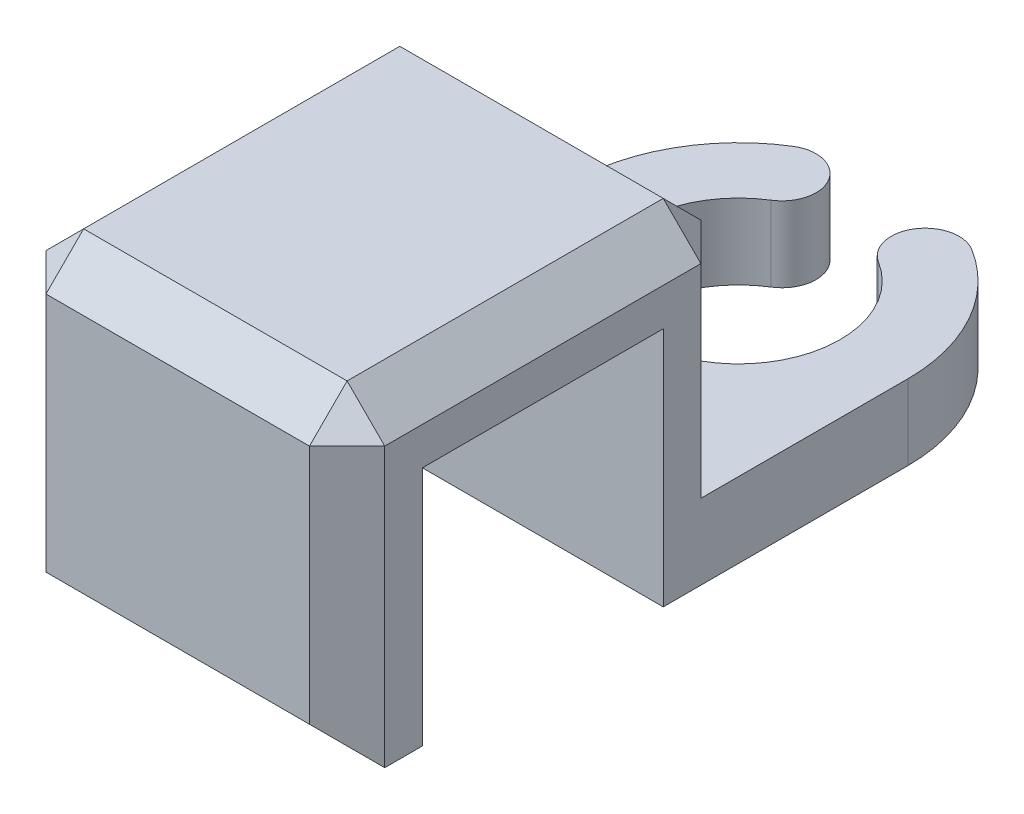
from build123d import *

# Parameters (mm, degrees)
EXTRUDE_1_DEPTH = 10
EXTRUDE_2_DEPTH = 45
CHAMFER_1_SIZE  = 5


with BuildPart() as part:
    # Sketch 1 → Extrude 1 (new body)
    with BuildSketch(Plane(origin=(0, 0, 0), x_dir=(1, 0, 0), z_dir=(0, 1, 0))):
        with BuildLine():
            Line((22.5, 0), (22.5, -22.5))
            Line((22.5, -22.5), (-22.5, -22.5))
            Line((-22.5, -22.5), (-22.5, 0))
            ThreePointArc((-22.5, 0), (-19.665165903, 10.933034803), (-11.875, 19.111106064))
            ThreePointArc((-11.875, 19.111106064), (-5.677778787, 17.663884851), (-7.125, 11.466663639))
            ThreePointArc((-7.125, 11.466663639), (0, -13.5), (7.125, 11.466663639))
            ThreePointArc((7.125, 11.466663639), (5.677778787, 17.663884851), (11.875, 19.111106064))
            ThreePointArc((11.875, 19.111106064), (19.665165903, 10.933034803), (22.5, 0))
        make_face()
    extrude(amount=EXTRUDE_1_DEPTH)

    # Sketch 3 → Extrude 2 (add)
    with BuildSketch(Plane(origin=(22.5, 0, 0), x_dir=(0, 0, -1), z_dir=(1, 0, 0))):
        Polygon((-22.5, 0), (-22.5, 42), (-74.5, 42), (-74.5, 0), (-64.5, 0), (-64.5, 32), (-32.5, 32), (-32.5, 0), align=None)
    extrude(amount=-EXTRUDE_2_DEPTH)

    # Chamfer 1
    chamfer_1_edges = [part.edges().sort_by_distance(p)[0] for p in [
        (0, 0, 74.5),
        (22.5, 21, 74.5),
        (-22.5, 21, 74.5),
        (0, 42, 74.5),
        (22.5, 42, 48.5),
        (-22.5, 42, 48.5),
        (-22.5, 26, 22.5),
        (22.5, 26, 22.5),
        (0, 42, 22.5),
    ]]
    chamfer(chamfer_1_edges, length=CHAMFER_1_SIZE)


solid = part.part
